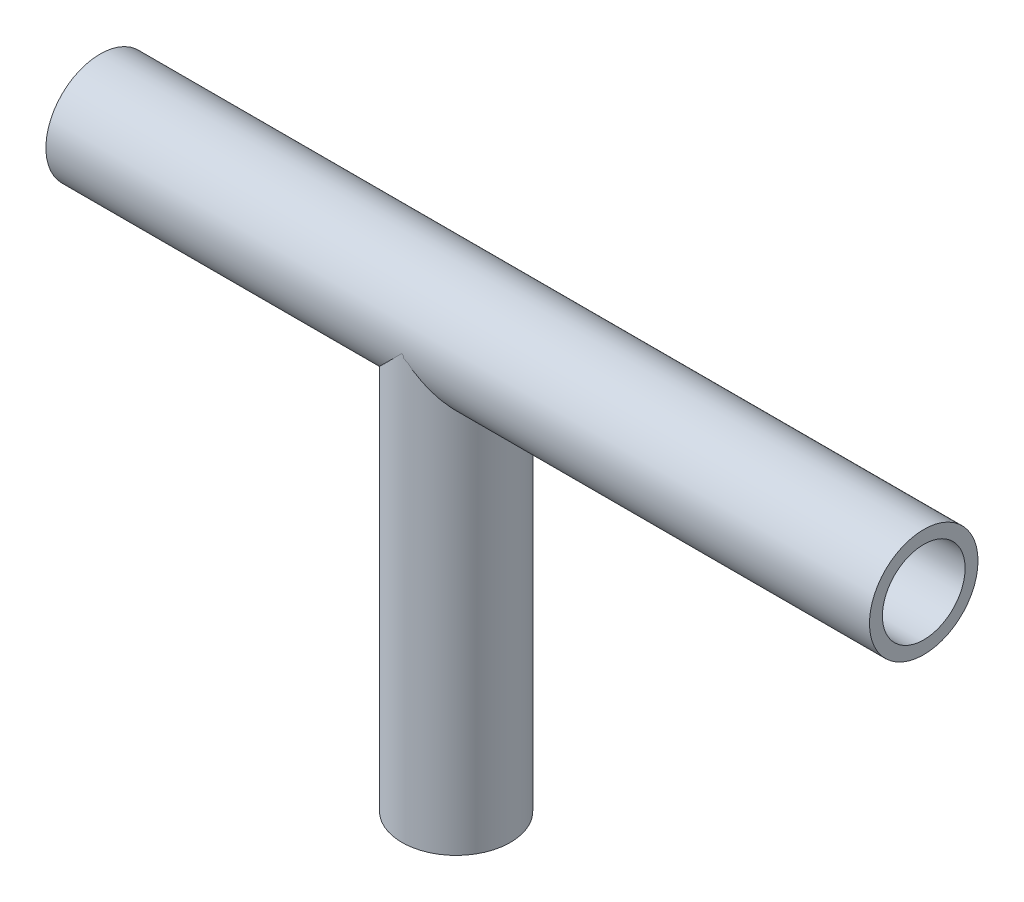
ISO-10303-21;
HEADER;
FILE_DESCRIPTION(('STEP AP214'),'2;1');
FILE_NAME('part.step','',(''),(''),'','','');
FILE_SCHEMA(('AUTOMOTIVE_DESIGN { 1 0 10303 214 1 1 1 1 }'));
ENDSEC;
DATA;
#1=APPLICATION_CONTEXT('core data for automotive mechanical design processes');
#2=APPLICATION_PROTOCOL_DEFINITION('international standard','automotive_design',2000,#1);
#3=PRODUCT_CONTEXT('',#1,'mechanical');
#4=PRODUCT('Part','Part','',(#3));
#5=PRODUCT_RELATED_PRODUCT_CATEGORY('part','',(#4));
#6=PRODUCT_DEFINITION_FORMATION('','',#4);
#7=PRODUCT_DEFINITION_CONTEXT('part definition',#1,'design');
#8=PRODUCT_DEFINITION('design','',#6,#7);
#9=PRODUCT_DEFINITION_SHAPE('','',#8);
#10=(LENGTH_UNIT() NAMED_UNIT(*) SI_UNIT(.MILLI.,.METRE.));
#11=(NAMED_UNIT(*) PLANE_ANGLE_UNIT() SI_UNIT($,.RADIAN.));
#12=(NAMED_UNIT(*) SI_UNIT($,.STERADIAN.) SOLID_ANGLE_UNIT());
#13=UNCERTAINTY_MEASURE_WITH_UNIT(LENGTH_MEASURE(1.E-05),#10,'distance_accuracy_value','');
#14=(GEOMETRIC_REPRESENTATION_CONTEXT(3) GLOBAL_UNCERTAINTY_ASSIGNED_CONTEXT((#13)) GLOBAL_UNIT_ASSIGNED_CONTEXT((#10,
#11,#12)) REPRESENTATION_CONTEXT('',''));
#15=CARTESIAN_POINT('',(0.,0.,0.));
#16=DIRECTION('',(0.,0.,1.));
#17=DIRECTION('',(1.,0.,0.));
#18=AXIS2_PLACEMENT_3D('',#15,#16,#17);
#19=CARTESIAN_POINT('',(0.,-104.982475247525,0.));
#20=DIRECTION('',(0.,1.,0.));
#21=DIRECTION('',(0.,0.,1.));
#22=AXIS2_PLACEMENT_3D('',#19,#20,#21);
#23=CYLINDRICAL_SURFACE('',#22,10.25);
#24=CARTESIAN_POINT('',(0.,-104.982475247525,0.));
#25=DIRECTION('',(0.,-1.,0.));
#26=DIRECTION('',(0.,0.,-1.));
#27=AXIS2_PLACEMENT_3D('',#24,#25,#26);
#28=CIRCLE('',#27,10.25);
#29=CARTESIAN_POINT('',(0.,-104.982475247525,-10.25));
#30=VERTEX_POINT('',#29);
#31=EDGE_CURVE('E87',#30,#30,#28,.T.);
#32=ORIENTED_EDGE('',*,*,#31,.T.);
#33=EDGE_LOOP('',(#32));
#34=FACE_BOUND('',#33,.T.);
#35=CARTESIAN_POINT('',(0.,-8.7086164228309,10.25));
#36=CARTESIAN_POINT('',(0.237482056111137,-8.70862157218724,10.2499975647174));
#37=CARTESIAN_POINT('',(0.474995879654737,-8.71838791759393,10.2417224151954));
#38=CARTESIAN_POINT('',(0.947350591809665,-8.75682508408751,10.2088748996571));
#39=CARTESIAN_POINT('',(1.18219089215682,-8.7854999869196,10.1842990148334));
#40=CARTESIAN_POINT('',(1.64757380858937,-8.86011044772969,10.1194551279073));
#41=CARTESIAN_POINT('',(1.87810192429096,-8.90609600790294,10.079141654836));
#42=CARTESIAN_POINT('',(2.33260061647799,-9.01288878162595,9.98375903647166));
#43=CARTESIAN_POINT('',(2.55656854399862,-9.07370189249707,9.92868401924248));
#44=CARTESIAN_POINT('',(3.04270192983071,-9.22137711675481,9.7918746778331));
#45=CARTESIAN_POINT('',(3.30312596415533,-9.31102635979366,9.7069782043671));
#46=CARTESIAN_POINT('',(3.81208934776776,-9.50349699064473,9.5186222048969));
#47=CARTESIAN_POINT('',(4.06062523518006,-9.60632218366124,9.4151573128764));
#48=CARTESIAN_POINT('',(4.54575571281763,-9.82123023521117,9.19076128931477));
#49=CARTESIAN_POINT('',(4.78233965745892,-9.93332112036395,9.06981494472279));
#50=CARTESIAN_POINT('',(5.24327632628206,-10.1632700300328,8.81137696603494));
#51=CARTESIAN_POINT('',(5.46763012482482,-10.2811275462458,8.67388678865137));
#52=CARTESIAN_POINT('',(5.90934044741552,-10.5226086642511,8.3793997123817));
#53=CARTESIAN_POINT('',(6.1263977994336,-10.646302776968,8.22201239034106));
#54=CARTESIAN_POINT('',(6.54742870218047,-10.8940286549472,7.89084340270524));
#55=CARTESIAN_POINT('',(6.75140179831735,-11.0180604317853,7.7170611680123));
#56=CARTESIAN_POINT('',(7.14562333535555,-11.2639347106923,7.35352914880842));
#57=CARTESIAN_POINT('',(7.33588343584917,-11.3857790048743,7.16379323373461));
#58=CARTESIAN_POINT('',(7.70220649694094,-11.6251781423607,6.76839436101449));
#59=CARTESIAN_POINT('',(7.87826485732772,-11.7427315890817,6.56272628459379));
#60=CARTESIAN_POINT('',(8.20803022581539,-11.9665252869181,6.14480068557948));
#61=CARTESIAN_POINT('',(8.36236562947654,-12.0730333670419,5.93318336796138));
#62=CARTESIAN_POINT('',(8.65585580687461,-12.2781444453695,5.49617090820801));
#63=CARTESIAN_POINT('',(8.79501766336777,-12.3767511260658,5.27078227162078));
#64=CARTESIAN_POINT('',(9.05689161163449,-12.5641924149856,4.80688289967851));
#65=CARTESIAN_POINT('',(9.1796108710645,-12.6530312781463,4.56837794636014));
#66=CARTESIAN_POINT('',(9.40722715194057,-12.8191211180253,4.07913339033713));
#67=CARTESIAN_POINT('',(9.51212710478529,-12.8963740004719,3.82839580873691));
#68=CARTESIAN_POINT('',(9.68846399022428,-13.0270248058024,3.35414883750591));
#69=CARTESIAN_POINT('',(9.76255719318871,-13.0822617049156,3.13213140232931));
#70=CARTESIAN_POINT('',(9.89586398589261,-13.1820396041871,2.68134232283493));
#71=CARTESIAN_POINT('',(9.95508013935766,-13.2265824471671,2.45257184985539));
#72=CARTESIAN_POINT('',(10.057820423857,-13.3040826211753,1.98970358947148));
#73=CARTESIAN_POINT('',(10.1013515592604,-13.3370451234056,1.75560822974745));
#74=CARTESIAN_POINT('',(10.1721145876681,-13.3907200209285,1.28356441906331));
#75=CARTESIAN_POINT('',(10.1993462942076,-13.4114322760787,1.04561592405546));
#76=CARTESIAN_POINT('',(10.2371307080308,-13.4401895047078,0.566962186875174));
#77=CARTESIAN_POINT('',(10.2476368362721,-13.4481991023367,0.326251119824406));
#78=CARTESIAN_POINT('',(10.251651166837,-13.4512583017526,-0.155396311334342));
#79=CARTESIAN_POINT('',(10.2451593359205,-13.4463078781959,-0.39633267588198));
#80=CARTESIAN_POINT('',(10.2152834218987,-13.4235584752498,-0.876570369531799));
#81=CARTESIAN_POINT('',(10.1918971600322,-13.4057578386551,-1.11587148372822));
#82=CARTESIAN_POINT('',(10.1286058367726,-13.3577031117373,-1.59100087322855));
#83=CARTESIAN_POINT('',(10.0887009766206,-13.327449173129,-1.82682919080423));
#84=CARTESIAN_POINT('',(9.9949435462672,-13.2566207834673,-2.28380542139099));
#85=CARTESIAN_POINT('',(9.94172960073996,-13.2165200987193,-2.5051588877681));
#86=CARTESIAN_POINT('',(9.82133083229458,-13.1261934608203,-2.94199103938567));
#87=CARTESIAN_POINT('',(9.75414116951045,-13.0759640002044,-3.15746766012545));
#88=CARTESIAN_POINT('',(9.60659480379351,-12.966272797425,-3.58136774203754));
#89=CARTESIAN_POINT('',(9.52624133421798,-12.9068133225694,-3.78979292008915));
#90=CARTESIAN_POINT('',(9.35313974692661,-12.7795844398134,-4.19888469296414));
#91=CARTESIAN_POINT('',(9.26038712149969,-12.7118120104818,-4.39954843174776));
#92=CARTESIAN_POINT('',(9.05290148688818,-12.561424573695,-4.81316012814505));
#93=CARTESIAN_POINT('',(8.93688163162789,-12.4779979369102,-5.02516717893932));
#94=CARTESIAN_POINT('',(8.69168642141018,-12.3035760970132,-5.43827338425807));
#95=CARTESIAN_POINT('',(8.56250556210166,-12.2125777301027,-5.63936792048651));
#96=CARTESIAN_POINT('',(8.2918972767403,-12.0243959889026,-6.03021240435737));
#97=CARTESIAN_POINT('',(8.15046498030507,-11.9272101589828,-6.21995778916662));
#98=CARTESIAN_POINT('',(7.8561810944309,-11.7280792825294,-6.58774619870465));
#99=CARTESIAN_POINT('',(7.70332807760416,-11.626133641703,-6.76578775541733));
#100=CARTESIAN_POINT('',(7.35522271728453,-11.3981876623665,-7.14436084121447));
#101=CARTESIAN_POINT('',(7.15760162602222,-11.2714515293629,-7.34227651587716));
#102=CARTESIAN_POINT('',(6.7476715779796,-11.0156887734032,-7.72070383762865));
#103=CARTESIAN_POINT('',(6.53535988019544,-10.8866617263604,-7.90121222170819));
#104=CARTESIAN_POINT('',(6.09644159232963,-10.6289699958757,-8.24461050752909));
#105=CARTESIAN_POINT('',(5.86982526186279,-10.5003056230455,-8.40748819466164));
#106=CARTESIAN_POINT('',(5.40270731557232,-10.2465011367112,-8.71501189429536));
#107=CARTESIAN_POINT('',(5.16220846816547,-10.1213603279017,-8.85966152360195));
#108=CARTESIAN_POINT('',(4.71190380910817,-9.90004265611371,-9.10570750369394));
#109=CARTESIAN_POINT('',(4.50435965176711,-9.80270518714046,-9.2102037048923));
#110=CARTESIAN_POINT('',(4.0799655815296,-9.61508664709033,-9.40590115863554));
#111=CARTESIAN_POINT('',(3.86311555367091,-9.52480566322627,-9.49710224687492));
#112=CARTESIAN_POINT('',(3.42066115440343,-9.35410857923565,-9.66527226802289));
#113=CARTESIAN_POINT('',(3.19507298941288,-9.27367526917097,-9.74226615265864));
#114=CARTESIAN_POINT('',(2.73528498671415,-9.12548627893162,-9.88121096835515));
#115=CARTESIAN_POINT('',(2.50108886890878,-9.05772519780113,-9.94316831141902));
#116=CARTESIAN_POINT('',(2.07736224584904,-8.9511519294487,-10.0390902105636));
#117=CARTESIAN_POINT('',(1.88932226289,-8.90925035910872,-10.0762142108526));
#118=CARTESIAN_POINT('',(1.50945742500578,-8.836501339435,-10.1400736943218));
#119=CARTESIAN_POINT('',(1.31763481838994,-8.80564752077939,-10.1668151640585));
#120=CARTESIAN_POINT('',(0.931408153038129,-8.7561916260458,-10.2094407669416));
#121=CARTESIAN_POINT('',(0.737006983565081,-8.73757685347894,-10.2253361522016));
#122=CARTESIAN_POINT('',(0.346794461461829,-8.71334362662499,-10.2459943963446));
#123=CARTESIAN_POINT('',(0.150983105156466,-8.70772520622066,-10.250757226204));
#124=CARTESIAN_POINT('',(-0.240826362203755,-8.70973935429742,-10.2490459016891));
#125=CARTESIAN_POINT('',(-0.436824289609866,-8.71739255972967,-10.2425542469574));
#126=CARTESIAN_POINT('',(-0.827179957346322,-8.74564574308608,-10.2184401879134));
#127=CARTESIAN_POINT('',(-1.02153769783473,-8.76624571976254,-10.2008177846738));
#128=CARTESIAN_POINT('',(-1.40748174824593,-8.81954784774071,-10.1547678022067));
#129=CARTESIAN_POINT('',(-1.599064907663,-8.85226278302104,-10.1263288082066));
#130=CARTESIAN_POINT('',(-1.97829604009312,-8.92855585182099,-10.0591235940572));
#131=CARTESIAN_POINT('',(-2.16594160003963,-8.97214044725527,-10.0203512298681));
#132=CARTESIAN_POINT('',(-2.60124260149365,-9.08560416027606,-9.91776238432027));
#133=CARTESIAN_POINT('',(-2.84694882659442,-9.1593492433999,-9.84992908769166));
#134=CARTESIAN_POINT('',(-3.32854562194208,-9.32028093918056,-9.69778863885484));
#135=CARTESIAN_POINT('',(-3.56443616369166,-9.40746759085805,-9.61348143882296));
#136=CARTESIAN_POINT('',(-4.02662773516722,-9.59211795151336,-9.42925337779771));
#137=CARTESIAN_POINT('',(-4.25290224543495,-9.68960778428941,-9.32929250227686));
#138=CARTESIAN_POINT('',(-4.69507417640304,-9.89166597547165,-9.11477749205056));
#139=CARTESIAN_POINT('',(-4.91097159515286,-9.99623433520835,-9.00022335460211));
#140=CARTESIAN_POINT('',(-5.39596113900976,-10.2420914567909,-8.72045748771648));
#141=CARTESIAN_POINT('',(-5.66146665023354,-10.3849461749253,-8.55038554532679));
#142=CARTESIAN_POINT('',(-6.17480149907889,-10.6734783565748,-8.18737883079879));
#143=CARTESIAN_POINT('',(-6.42262543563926,-10.8191566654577,-7.99443712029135));
#144=CARTESIAN_POINT('',(-6.89984402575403,-11.1090943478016,-7.58637824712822));
#145=CARTESIAN_POINT('',(-7.1292512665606,-11.2533546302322,-7.37127646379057));
#146=CARTESIAN_POINT('',(-7.56877216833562,-11.5368163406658,-6.91921363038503));
#147=CARTESIAN_POINT('',(-7.7788913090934,-11.6760191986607,-6.68225882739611));
#148=CARTESIAN_POINT('',(-8.14313383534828,-11.9220781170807,-6.23061323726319));
#149=CARTESIAN_POINT('',(-8.30059874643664,-12.030310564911,-6.01936113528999));
#150=CARTESIAN_POINT('',(-8.60032915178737,-12.2390397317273,-5.58273506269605));
#151=CARTESIAN_POINT('',(-8.74259735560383,-12.3395378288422,-5.35736362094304));
#152=CARTESIAN_POINT('',(-9.01050400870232,-12.53077797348,-4.89336279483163));
#153=CARTESIAN_POINT('',(-9.13616135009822,-12.6215310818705,-4.65474891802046));
#154=CARTESIAN_POINT('',(-9.36957991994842,-12.7915061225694,-4.16497557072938));
#155=CARTESIAN_POINT('',(-9.47734389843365,-12.8707298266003,-3.9138180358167));
#156=CARTESIAN_POINT('',(-9.6585522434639,-13.0047879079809,-3.43935952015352));
#157=CARTESIAN_POINT('',(-9.73472343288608,-13.0614990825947,-3.2176277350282));
#158=CARTESIAN_POINT('',(-9.87220526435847,-13.1642831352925,-2.76721537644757));
#159=CARTESIAN_POINT('',(-9.93351857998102,-13.2103579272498,-2.53853606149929));
#160=CARTESIAN_POINT('',(-10.0404564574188,-13.2909567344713,-2.07560754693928));
#161=CARTESIAN_POINT('',(-10.0860861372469,-13.3254845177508,-1.84136019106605));
#162=CARTESIAN_POINT('',(-10.161011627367,-13.3822852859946,-1.36878499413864));
#163=CARTESIAN_POINT('',(-10.1903072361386,-13.4045581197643,-1.1304571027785));
#164=CARTESIAN_POINT('',(-10.2321609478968,-13.4364032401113,-0.650776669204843));
#165=CARTESIAN_POINT('',(-10.2446696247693,-13.4459380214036,-0.40941729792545));
#166=CARTESIAN_POINT('',(-10.2525820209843,-13.4519675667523,0.0737463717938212));
#167=CARTESIAN_POINT('',(-10.2479857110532,-13.4484623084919,0.315550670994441));
#168=CARTESIAN_POINT('',(-10.2217639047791,-13.4284915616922,0.797710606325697));
#169=CARTESIAN_POINT('',(-10.2001369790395,-13.4120249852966,1.0380661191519));
#170=CARTESIAN_POINT('',(-10.140203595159,-13.3665010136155,1.51546972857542));
#171=CARTESIAN_POINT('',(-10.1018973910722,-13.3374438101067,1.75251787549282));
#172=CARTESIAN_POINT('',(-10.0112775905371,-13.2689427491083,2.21110495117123));
#173=CARTESIAN_POINT('',(-9.95966903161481,-13.2300229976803,2.43286272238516));
#174=CARTESIAN_POINT('',(-9.84242324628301,-13.141986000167,2.87064002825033));
#175=CARTESIAN_POINT('',(-9.77678116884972,-13.0928652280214,3.08665754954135));
#176=CARTESIAN_POINT('',(-9.63226178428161,-12.9853047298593,3.51175526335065));
#177=CARTESIAN_POINT('',(-9.55338767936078,-12.926867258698,3.72083711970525));
#178=CARTESIAN_POINT('',(-9.38317376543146,-12.8015870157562,4.13133714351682));
#179=CARTESIAN_POINT('',(-9.29182941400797,-12.7347411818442,4.33275248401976));
#180=CARTESIAN_POINT('',(-9.08760520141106,-12.5864667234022,4.74727417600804));
#181=CARTESIAN_POINT('',(-8.97347963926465,-12.5042463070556,4.95948326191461));
#182=CARTESIAN_POINT('',(-8.73208073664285,-12.3321557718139,5.37314137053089));
#183=CARTESIAN_POINT('',(-8.60480190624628,-12.2422824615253,5.57458584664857));
#184=CARTESIAN_POINT('',(-8.33801090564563,-12.0562546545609,5.96625875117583));
#185=CARTESIAN_POINT('',(-8.19849427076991,-11.9600978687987,6.15648304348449));
#186=CARTESIAN_POINT('',(-7.90805599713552,-11.7629070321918,6.52535587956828));
#187=CARTESIAN_POINT('',(-7.75713292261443,-11.6618723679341,6.70400296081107));
#188=CARTESIAN_POINT('',(-7.41347721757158,-11.4358949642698,7.08384436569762));
#189=CARTESIAN_POINT('',(-7.2183957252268,-11.3101907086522,7.28246554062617));
#190=CARTESIAN_POINT('',(-6.81362815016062,-11.0562505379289,7.66251040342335));
#191=CARTESIAN_POINT('',(-6.60393943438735,-10.9280141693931,7.84393097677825));
#192=CARTESIAN_POINT('',(-6.17036655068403,-10.6715898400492,8.18938142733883));
#193=CARTESIAN_POINT('',(-5.94647225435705,-10.5434019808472,8.35339866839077));
#194=CARTESIAN_POINT('',(-5.48492276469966,-10.2901476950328,8.66345203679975));
#195=CARTESIAN_POINT('',(-5.24727006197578,-10.165080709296,8.80949140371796));
#196=CARTESIAN_POINT('',(-4.79852235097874,-9.94155295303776,9.06043261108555));
#197=CARTESIAN_POINT('',(-4.58949331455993,-9.84210086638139,9.1681492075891));
#198=CARTESIAN_POINT('',(-4.16186943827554,-9.65011168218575,9.37001817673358));
#199=CARTESIAN_POINT('',(-3.94327439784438,-9.55757472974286,9.4641702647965));
#200=CARTESIAN_POINT('',(-3.49702198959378,-9.38227770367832,9.63797594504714));
#201=CARTESIAN_POINT('',(-3.26937989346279,-9.29950201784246,9.71765280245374));
#202=CARTESIAN_POINT('',(-2.80517804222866,-9.14664267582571,9.86166654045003));
#203=CARTESIAN_POINT('',(-2.5686222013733,-9.07655352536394,9.92601006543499));
#204=CARTESIAN_POINT('',(-2.1410035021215,-8.96611558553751,10.0257426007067));
#205=CARTESIAN_POINT('',(-1.95151158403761,-8.92261898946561,10.0643884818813));
#206=CARTESIAN_POINT('',(-1.56856377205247,-8.84676283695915,10.1311325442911));
#207=CARTESIAN_POINT('',(-1.37511025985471,-8.81439678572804,10.159236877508));
#208=CARTESIAN_POINT('',(-0.985466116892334,-8.76207387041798,10.2043993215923));
#209=CARTESIAN_POINT('',(-0.789278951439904,-8.74210253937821,10.2214703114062));
#210=CARTESIAN_POINT('',(-0.395401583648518,-8.71537345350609,10.2442701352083));
#211=CARTESIAN_POINT('',(-0.197711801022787,-8.7086121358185,10.2500020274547));
#212=CARTESIAN_POINT('',(0.,-8.7086164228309,10.25));
#213=B_SPLINE_CURVE_WITH_KNOTS('',3,(#35,#36,#37,#38,#39,#40,#41,#42,#43,#44,#45,#46,#47,#48,
#49,#50,#51,#52,#53,#54,#55,#56,#57,#58,#59,#60,#61,#62,#63,#64,#65,#66,#67,#68,#69,#70,#71,#72,
#73,#74,#75,#76,#77,#78,#79,#80,#81,#82,#83,#84,#85,#86,#87,#88,#89,#90,#91,#92,#93,#94,#95,#96,
#97,#98,#99,#100,#101,#102,#103,#104,#105,#106,#107,#108,#109,#110,#111,#112,#113,#114,#115,
#116,#117,#118,#119,#120,#121,#122,#123,#124,#125,#126,#127,#128,#129,#130,#131,#132,#133,#134,
#135,#136,#137,#138,#139,#140,#141,#142,#143,#144,#145,#146,#147,#148,#149,#150,#151,#152,#153,
#154,#155,#156,#157,#158,#159,#160,#161,#162,#163,#164,#165,#166,#167,#168,#169,#170,#171,#172,
#173,#174,#175,#176,#177,#178,#179,#180,#181,#182,#183,#184,#185,#186,#187,#188,#189,#190,#191,
#192,#193,#194,#195,#196,#197,#198,#199,#200,#201,#202,#203,#204,#205,#206,#207,#208,#209,#210,
#211,#212),.UNSPECIFIED.,.T.,.F.,(4,2,2,2,2,2,2,2,2,2,2,2,2,2,2,2,2,2,2,2,2,2,2,2,2,2,2,2,2,2,2,
2,2,2,2,2,2,2,2,2,2,2,2,2,2,2,2,2,2,2,2,2,2,2,2,2,2,2,2,2,2,2,2,2,2,2,2,2,2,2,2,2,2,2,2,2,2,2,2,
2,2,2,2,2,2,2,2,2,4),(0.,0.71216674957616,1.42448728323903,2.13888135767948,2.85356003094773,
3.71684976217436,4.5803893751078,5.44468505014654,6.30890467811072,7.19396319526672,
8.07905244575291,8.96338003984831,9.84799294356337,10.6954280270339,11.5424658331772,
12.3891331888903,13.2356611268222,13.9563719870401,14.6769585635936,15.3972229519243,
16.1174955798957,16.8397706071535,17.5620470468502,18.2844166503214,19.0067774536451,
19.6995345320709,20.3925319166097,21.0853593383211,21.7784393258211,22.5447188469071,
23.3113201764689,24.0782276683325,24.8452311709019,25.7655123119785,26.6859656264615,
27.6070526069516,28.5279565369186,29.2831927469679,30.0384382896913,30.7923445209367,
31.5459286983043,32.1339587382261,32.7216492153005,33.3087290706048,33.8958104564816,
34.4838055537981,35.0718005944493,35.6604178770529,36.2493859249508,37.0442125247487,
37.8390414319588,38.6359363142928,39.4328313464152,40.4699825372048,41.5074491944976,
42.5442006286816,43.5806566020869,44.434404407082,45.2879997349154,46.1406157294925,
46.9931005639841,47.7159963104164,48.4387618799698,49.161291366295,49.8838297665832,
50.6084909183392,51.3331533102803,52.0578765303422,52.7825887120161,53.4748078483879,
54.1672666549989,54.8595581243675,55.5521024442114,56.3151500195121,57.0785173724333,
57.8421643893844,58.6059076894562,59.5214067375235,60.4370712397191,61.3533960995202,
62.2695555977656,63.0349399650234,63.8003403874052,64.5644995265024,65.3283269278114,
65.9224312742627,66.5161883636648,67.1092511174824,67.7021538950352),.UNSPECIFIED.);
#214=CARTESIAN_POINT('',(0.,-8.7086164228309,10.25));
#215=VERTEX_POINT('',#214);
#216=EDGE_CURVE('E52',#215,#215,#213,.T.);
#217=ORIENTED_EDGE('',*,*,#216,.T.);
#218=EDGE_LOOP('',(#217));
#219=FACE_BOUND('',#218,.T.);
#220=ADVANCED_FACE('F47',(#34,#219),#23,.F.);
#221=CARTESIAN_POINT('',(0.,-104.982475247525,0.));
#222=DIRECTION('',(0.,1.,0.));
#223=DIRECTION('',(0.,0.,1.));
#224=AXIS2_PLACEMENT_3D('',#221,#222,#223);
#225=CYLINDRICAL_SURFACE('',#224,13.45);
#226=CARTESIAN_POINT('',(0.,-104.982475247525,0.));
#227=DIRECTION('',(0.,-1.,0.));
#228=DIRECTION('',(0.,0.,-1.));
#229=AXIS2_PLACEMENT_3D('',#226,#227,#228);
#230=CIRCLE('',#229,13.45);
#231=CARTESIAN_POINT('',(0.,-104.982475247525,-13.45));
#232=VERTEX_POINT('',#231);
#233=EDGE_CURVE('E68',#232,#232,#230,.T.);
#234=ORIENTED_EDGE('',*,*,#233,.F.);
#235=EDGE_LOOP('',(#234));
#236=FACE_BOUND('',#235,.T.);
#237=CARTESIAN_POINT('',(0.,0.,0.));
#238=DIRECTION('',(-0.707106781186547,0.707106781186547,0.));
#239=DIRECTION('',(0.707106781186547,0.707106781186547,0.));
#240=AXIS2_PLACEMENT_3D('',#237,#238,#239);
#241=ELLIPSE('',#240,19.0211724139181,13.45);
#242=CARTESIAN_POINT('',(0.,0.,-13.45));
#243=VERTEX_POINT('',#242);
#244=CARTESIAN_POINT('',(0.,0.,13.45));
#245=VERTEX_POINT('',#244);
#246=EDGE_CURVE('E61',#243,#245,#241,.T.);
#247=ORIENTED_EDGE('',*,*,#246,.F.);
#248=CARTESIAN_POINT('',(0.,0.,0.));
#249=DIRECTION('',(0.707106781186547,0.707106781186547,0.));
#250=DIRECTION('',(-0.707106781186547,0.707106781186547,0.));
#251=AXIS2_PLACEMENT_3D('',#248,#249,#250);
#252=ELLIPSE('',#251,19.0211724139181,13.45);
#253=EDGE_CURVE('E12',#245,#243,#252,.T.);
#254=ORIENTED_EDGE('',*,*,#253,.F.);
#255=EDGE_LOOP('',(#247,#254));
#256=FACE_BOUND('',#255,.T.);
#257=ADVANCED_FACE('F70',(#236,#256),#225,.T.);
#258=CARTESIAN_POINT('',(0.,-104.982475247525,0.));
#259=DIRECTION('',(0.,-1.,0.));
#260=DIRECTION('',(0.,0.,-1.));
#261=AXIS2_PLACEMENT_3D('',#258,#259,#260);
#262=PLANE('',#261);
#263=ORIENTED_EDGE('',*,*,#31,.F.);
#264=EDGE_LOOP('',(#263));
#265=FACE_BOUND('',#264,.T.);
#266=ORIENTED_EDGE('',*,*,#233,.T.);
#267=EDGE_LOOP('',(#266));
#268=FACE_BOUND('',#267,.T.);
#269=ADVANCED_FACE('F72',(#265,#268),#262,.T.);
#270=CARTESIAN_POINT('',(115.909504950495,0.,0.));
#271=DIRECTION('',(-1.,0.,0.));
#272=DIRECTION('',(0.,0.,1.));
#273=AXIS2_PLACEMENT_3D('',#270,#271,#272);
#274=CYLINDRICAL_SURFACE('',#273,13.45);
#275=ORIENTED_EDGE('',*,*,#216,.F.);
#276=EDGE_LOOP('',(#275));
#277=FACE_BOUND('',#276,.T.);
#278=ORIENTED_EDGE('',*,*,#246,.T.);
#279=ORIENTED_EDGE('',*,*,#253,.T.);
#280=EDGE_LOOP('',(#278,#279));
#281=FACE_BOUND('',#280,.T.);
#282=ADVANCED_FACE('F49',(#277,#281),#274,.F.);
#283=CLOSED_SHELL('',(#220,#257,#269,#282));
#284=MANIFOLD_SOLID_BREP('B2',#283);
#285=CARTESIAN_POINT('',(115.909504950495,0.,0.));
#286=DIRECTION('',(-1.,0.,0.));
#287=DIRECTION('',(0.,0.,1.));
#288=AXIS2_PLACEMENT_3D('',#285,#286,#287);
#289=CYLINDRICAL_SURFACE('',#288,10.25);
#290=CARTESIAN_POINT('',(0.,0.,0.));
#291=DIRECTION('',(-0.707106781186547,-0.707106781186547,0.));
#292=DIRECTION('',(-0.707106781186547,0.707106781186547,0.));
#293=AXIS2_PLACEMENT_3D('',#290,#291,#292);
#294=ELLIPSE('',#293,14.4956890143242,10.25);
#295=CARTESIAN_POINT('',(0.,0.,10.25));
#296=VERTEX_POINT('',#295);
#297=CARTESIAN_POINT('',(0.,0.,-10.25));
#298=VERTEX_POINT('',#297);
#299=EDGE_CURVE('E145',#296,#298,#294,.F.);
#300=ORIENTED_EDGE('',*,*,#299,.F.);
#301=CARTESIAN_POINT('',(0.,0.,0.));
#302=DIRECTION('',(-0.707106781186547,0.707106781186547,0.));
#303=DIRECTION('',(-0.707106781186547,-0.707106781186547,0.));
#304=AXIS2_PLACEMENT_3D('',#301,#302,#303);
#305=ELLIPSE('',#304,14.4956890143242,10.25);
#306=EDGE_CURVE('E147',#298,#296,#305,.T.);
#307=ORIENTED_EDGE('',*,*,#306,.F.);
#308=EDGE_LOOP('',(#300,#307));
#309=FACE_BOUND('',#308,.T.);
#310=CARTESIAN_POINT('',(115.909504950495,0.,0.));
#311=DIRECTION('',(1.,0.,0.));
#312=DIRECTION('',(0.,0.,-1.));
#313=AXIS2_PLACEMENT_3D('',#310,#311,#312);
#314=CIRCLE('',#313,10.25);
#315=CARTESIAN_POINT('',(115.909504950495,0.,-10.25));
#316=VERTEX_POINT('',#315);
#317=EDGE_CURVE('E138',#316,#316,#314,.T.);
#318=ORIENTED_EDGE('',*,*,#317,.T.);
#319=EDGE_LOOP('',(#318));
#320=FACE_BOUND('',#319,.T.);
#321=CARTESIAN_POINT('',(-88.2461386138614,0.,0.));
#322=DIRECTION('',(1.,0.,0.));
#323=DIRECTION('',(0.,0.,-1.));
#324=AXIS2_PLACEMENT_3D('',#321,#322,#323);
#325=CIRCLE('',#324,10.25);
#326=CARTESIAN_POINT('',(-88.2461386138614,0.,-10.25));
#327=VERTEX_POINT('',#326);
#328=EDGE_CURVE('E153',#327,#327,#325,.T.);
#329=ORIENTED_EDGE('',*,*,#328,.F.);
#330=EDGE_LOOP('',(#329));
#331=FACE_BOUND('',#330,.T.);
#332=ADVANCED_FACE('F127',(#309,#320,#331),#289,.F.);
#333=CARTESIAN_POINT('',(115.909504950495,0.,0.));
#334=DIRECTION('',(-1.,0.,0.));
#335=DIRECTION('',(0.,0.,1.));
#336=AXIS2_PLACEMENT_3D('',#333,#334,#335);
#337=CYLINDRICAL_SURFACE('',#336,13.45);
#338=CARTESIAN_POINT('',(0.,-8.7086164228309,-10.25));
#339=CARTESIAN_POINT('',(-0.237482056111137,-8.70862157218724,-10.2499975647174));
#340=CARTESIAN_POINT('',(-0.474995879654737,-8.71838791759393,-10.2417224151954));
#341=CARTESIAN_POINT('',(-0.947350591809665,-8.75682508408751,-10.2088748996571));
#342=CARTESIAN_POINT('',(-1.18219089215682,-8.7854999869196,-10.1842990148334));
#343=CARTESIAN_POINT('',(-1.64757380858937,-8.86011044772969,-10.1194551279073));
#344=CARTESIAN_POINT('',(-1.87810192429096,-8.90609600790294,-10.079141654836));
#345=CARTESIAN_POINT('',(-2.33260061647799,-9.01288878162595,-9.98375903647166));
#346=CARTESIAN_POINT('',(-2.55656854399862,-9.07370189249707,-9.92868401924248));
#347=CARTESIAN_POINT('',(-3.04270192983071,-9.22137711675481,-9.7918746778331));
#348=CARTESIAN_POINT('',(-3.30312596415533,-9.31102635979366,-9.7069782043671));
#349=CARTESIAN_POINT('',(-3.81208934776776,-9.50349699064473,-9.5186222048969));
#350=CARTESIAN_POINT('',(-4.06062523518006,-9.60632218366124,-9.4151573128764));
#351=CARTESIAN_POINT('',(-4.54575571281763,-9.82123023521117,-9.19076128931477));
#352=CARTESIAN_POINT('',(-4.78233965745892,-9.93332112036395,-9.06981494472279));
#353=CARTESIAN_POINT('',(-5.24327632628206,-10.1632700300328,-8.81137696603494));
#354=CARTESIAN_POINT('',(-5.46763012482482,-10.2811275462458,-8.67388678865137));
#355=CARTESIAN_POINT('',(-5.90934044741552,-10.5226086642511,-8.3793997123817));
#356=CARTESIAN_POINT('',(-6.1263977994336,-10.646302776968,-8.22201239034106));
#357=CARTESIAN_POINT('',(-6.54742870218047,-10.8940286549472,-7.89084340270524));
#358=CARTESIAN_POINT('',(-6.75140179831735,-11.0180604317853,-7.7170611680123));
#359=CARTESIAN_POINT('',(-7.14562333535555,-11.2639347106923,-7.35352914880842));
#360=CARTESIAN_POINT('',(-7.33588343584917,-11.3857790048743,-7.16379323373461));
#361=CARTESIAN_POINT('',(-7.70220649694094,-11.6251781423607,-6.76839436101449));
#362=CARTESIAN_POINT('',(-7.87826485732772,-11.7427315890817,-6.56272628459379));
#363=CARTESIAN_POINT('',(-8.20803022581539,-11.9665252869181,-6.14480068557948));
#364=CARTESIAN_POINT('',(-8.36236562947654,-12.0730333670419,-5.93318336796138));
#365=CARTESIAN_POINT('',(-8.65585580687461,-12.2781444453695,-5.49617090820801));
#366=CARTESIAN_POINT('',(-8.79501766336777,-12.3767511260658,-5.27078227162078));
#367=CARTESIAN_POINT('',(-9.05689161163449,-12.5641924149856,-4.80688289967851));
#368=CARTESIAN_POINT('',(-9.1796108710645,-12.6530312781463,-4.56837794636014));
#369=CARTESIAN_POINT('',(-9.40722715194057,-12.8191211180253,-4.07913339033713));
#370=CARTESIAN_POINT('',(-9.51212710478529,-12.8963740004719,-3.82839580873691));
#371=CARTESIAN_POINT('',(-9.68846399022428,-13.0270248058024,-3.35414883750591));
#372=CARTESIAN_POINT('',(-9.76255719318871,-13.0822617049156,-3.13213140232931));
#373=CARTESIAN_POINT('',(-9.89586398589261,-13.1820396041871,-2.68134232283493));
#374=CARTESIAN_POINT('',(-9.95508013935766,-13.2265824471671,-2.45257184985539));
#375=CARTESIAN_POINT('',(-10.057820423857,-13.3040826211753,-1.98970358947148));
#376=CARTESIAN_POINT('',(-10.1013515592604,-13.3370451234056,-1.75560822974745));
#377=CARTESIAN_POINT('',(-10.1721145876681,-13.3907200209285,-1.28356441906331));
#378=CARTESIAN_POINT('',(-10.1993462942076,-13.4114322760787,-1.04561592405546));
#379=CARTESIAN_POINT('',(-10.2371307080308,-13.4401895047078,-0.566962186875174));
#380=CARTESIAN_POINT('',(-10.2476368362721,-13.4481991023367,-0.326251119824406));
#381=CARTESIAN_POINT('',(-10.251651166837,-13.4512583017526,0.155396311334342));
#382=CARTESIAN_POINT('',(-10.2451593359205,-13.4463078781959,0.39633267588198));
#383=CARTESIAN_POINT('',(-10.2152834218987,-13.4235584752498,0.876570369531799));
#384=CARTESIAN_POINT('',(-10.1918971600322,-13.4057578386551,1.11587148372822));
#385=CARTESIAN_POINT('',(-10.1286058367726,-13.3577031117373,1.59100087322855));
#386=CARTESIAN_POINT('',(-10.0887009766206,-13.327449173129,1.82682919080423));
#387=CARTESIAN_POINT('',(-9.9949435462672,-13.2566207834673,2.28380542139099));
#388=CARTESIAN_POINT('',(-9.94172960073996,-13.2165200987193,2.5051588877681));
#389=CARTESIAN_POINT('',(-9.82133083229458,-13.1261934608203,2.94199103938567));
#390=CARTESIAN_POINT('',(-9.75414116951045,-13.0759640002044,3.15746766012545));
#391=CARTESIAN_POINT('',(-9.60659480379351,-12.966272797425,3.58136774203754));
#392=CARTESIAN_POINT('',(-9.52624133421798,-12.9068133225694,3.78979292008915));
#393=CARTESIAN_POINT('',(-9.35313974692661,-12.7795844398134,4.19888469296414));
#394=CARTESIAN_POINT('',(-9.26038712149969,-12.7118120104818,4.39954843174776));
#395=CARTESIAN_POINT('',(-9.05290148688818,-12.561424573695,4.81316012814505));
#396=CARTESIAN_POINT('',(-8.93688163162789,-12.4779979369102,5.02516717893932));
#397=CARTESIAN_POINT('',(-8.69168642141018,-12.3035760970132,5.43827338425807));
#398=CARTESIAN_POINT('',(-8.56250556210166,-12.2125777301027,5.63936792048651));
#399=CARTESIAN_POINT('',(-8.2918972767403,-12.0243959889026,6.03021240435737));
#400=CARTESIAN_POINT('',(-8.15046498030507,-11.9272101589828,6.21995778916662));
#401=CARTESIAN_POINT('',(-7.8561810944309,-11.7280792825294,6.58774619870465));
#402=CARTESIAN_POINT('',(-7.70332807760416,-11.626133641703,6.76578775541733));
#403=CARTESIAN_POINT('',(-7.35522271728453,-11.3981876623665,7.14436084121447));
#404=CARTESIAN_POINT('',(-7.15760162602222,-11.2714515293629,7.34227651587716));
#405=CARTESIAN_POINT('',(-6.7476715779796,-11.0156887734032,7.72070383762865));
#406=CARTESIAN_POINT('',(-6.53535988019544,-10.8866617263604,7.90121222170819));
#407=CARTESIAN_POINT('',(-6.09644159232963,-10.6289699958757,8.24461050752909));
#408=CARTESIAN_POINT('',(-5.86982526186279,-10.5003056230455,8.40748819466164));
#409=CARTESIAN_POINT('',(-5.40270731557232,-10.2465011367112,8.71501189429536));
#410=CARTESIAN_POINT('',(-5.16220846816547,-10.1213603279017,8.85966152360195));
#411=CARTESIAN_POINT('',(-4.71190380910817,-9.90004265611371,9.10570750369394));
#412=CARTESIAN_POINT('',(-4.50435965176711,-9.80270518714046,9.2102037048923));
#413=CARTESIAN_POINT('',(-4.0799655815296,-9.61508664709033,9.40590115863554));
#414=CARTESIAN_POINT('',(-3.86311555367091,-9.52480566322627,9.49710224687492));
#415=CARTESIAN_POINT('',(-3.42066115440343,-9.35410857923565,9.66527226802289));
#416=CARTESIAN_POINT('',(-3.19507298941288,-9.27367526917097,9.74226615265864));
#417=CARTESIAN_POINT('',(-2.73528498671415,-9.12548627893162,9.88121096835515));
#418=CARTESIAN_POINT('',(-2.50108886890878,-9.05772519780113,9.94316831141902));
#419=CARTESIAN_POINT('',(-2.07736224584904,-8.9511519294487,10.0390902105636));
#420=CARTESIAN_POINT('',(-1.88932226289,-8.90925035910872,10.0762142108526));
#421=CARTESIAN_POINT('',(-1.50945742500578,-8.836501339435,10.1400736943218));
#422=CARTESIAN_POINT('',(-1.31763481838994,-8.80564752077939,10.1668151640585));
#423=CARTESIAN_POINT('',(-0.931408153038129,-8.7561916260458,10.2094407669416));
#424=CARTESIAN_POINT('',(-0.737006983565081,-8.73757685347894,10.2253361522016));
#425=CARTESIAN_POINT('',(-0.346794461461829,-8.71334362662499,10.2459943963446));
#426=CARTESIAN_POINT('',(-0.150983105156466,-8.70772520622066,10.250757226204));
#427=CARTESIAN_POINT('',(0.240826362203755,-8.70973935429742,10.2490459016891));
#428=CARTESIAN_POINT('',(0.436824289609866,-8.71739255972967,10.2425542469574));
#429=CARTESIAN_POINT('',(0.827179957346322,-8.74564574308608,10.2184401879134));
#430=CARTESIAN_POINT('',(1.02153769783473,-8.76624571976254,10.2008177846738));
#431=CARTESIAN_POINT('',(1.40748174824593,-8.81954784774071,10.1547678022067));
#432=CARTESIAN_POINT('',(1.599064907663,-8.85226278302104,10.1263288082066));
#433=CARTESIAN_POINT('',(1.97829604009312,-8.92855585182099,10.0591235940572));
#434=CARTESIAN_POINT('',(2.16594160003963,-8.97214044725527,10.0203512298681));
#435=CARTESIAN_POINT('',(2.60124260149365,-9.08560416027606,9.91776238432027));
#436=CARTESIAN_POINT('',(2.84694882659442,-9.1593492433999,9.84992908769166));
#437=CARTESIAN_POINT('',(3.32854562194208,-9.32028093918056,9.69778863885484));
#438=CARTESIAN_POINT('',(3.56443616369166,-9.40746759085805,9.61348143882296));
#439=CARTESIAN_POINT('',(4.02662773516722,-9.59211795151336,9.42925337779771));
#440=CARTESIAN_POINT('',(4.25290224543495,-9.68960778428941,9.32929250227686));
#441=CARTESIAN_POINT('',(4.69507417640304,-9.89166597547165,9.11477749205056));
#442=CARTESIAN_POINT('',(4.91097159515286,-9.99623433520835,9.00022335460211));
#443=CARTESIAN_POINT('',(5.39596113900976,-10.2420914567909,8.72045748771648));
#444=CARTESIAN_POINT('',(5.66146665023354,-10.3849461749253,8.55038554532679));
#445=CARTESIAN_POINT('',(6.17480149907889,-10.6734783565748,8.18737883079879));
#446=CARTESIAN_POINT('',(6.42262543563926,-10.8191566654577,7.99443712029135));
#447=CARTESIAN_POINT('',(6.89984402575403,-11.1090943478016,7.58637824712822));
#448=CARTESIAN_POINT('',(7.1292512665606,-11.2533546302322,7.37127646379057));
#449=CARTESIAN_POINT('',(7.56877216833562,-11.5368163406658,6.91921363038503));
#450=CARTESIAN_POINT('',(7.7788913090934,-11.6760191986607,6.68225882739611));
#451=CARTESIAN_POINT('',(8.14313383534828,-11.9220781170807,6.23061323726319));
#452=CARTESIAN_POINT('',(8.30059874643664,-12.030310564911,6.01936113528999));
#453=CARTESIAN_POINT('',(8.60032915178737,-12.2390397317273,5.58273506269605));
#454=CARTESIAN_POINT('',(8.74259735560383,-12.3395378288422,5.35736362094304));
#455=CARTESIAN_POINT('',(9.01050400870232,-12.53077797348,4.89336279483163));
#456=CARTESIAN_POINT('',(9.13616135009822,-12.6215310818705,4.65474891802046));
#457=CARTESIAN_POINT('',(9.36957991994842,-12.7915061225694,4.16497557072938));
#458=CARTESIAN_POINT('',(9.47734389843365,-12.8707298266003,3.9138180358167));
#459=CARTESIAN_POINT('',(9.6585522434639,-13.0047879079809,3.43935952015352));
#460=CARTESIAN_POINT('',(9.73472343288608,-13.0614990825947,3.2176277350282));
#461=CARTESIAN_POINT('',(9.87220526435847,-13.1642831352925,2.76721537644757));
#462=CARTESIAN_POINT('',(9.93351857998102,-13.2103579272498,2.53853606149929));
#463=CARTESIAN_POINT('',(10.0404564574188,-13.2909567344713,2.07560754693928));
#464=CARTESIAN_POINT('',(10.0860861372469,-13.3254845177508,1.84136019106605));
#465=CARTESIAN_POINT('',(10.161011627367,-13.3822852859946,1.36878499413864));
#466=CARTESIAN_POINT('',(10.1903072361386,-13.4045581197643,1.1304571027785));
#467=CARTESIAN_POINT('',(10.2321609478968,-13.4364032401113,0.650776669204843));
#468=CARTESIAN_POINT('',(10.2446696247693,-13.4459380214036,0.40941729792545));
#469=CARTESIAN_POINT('',(10.2525820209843,-13.4519675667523,-0.0737463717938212));
#470=CARTESIAN_POINT('',(10.2479857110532,-13.4484623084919,-0.315550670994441));
#471=CARTESIAN_POINT('',(10.2217639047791,-13.4284915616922,-0.797710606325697));
#472=CARTESIAN_POINT('',(10.2001369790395,-13.4120249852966,-1.0380661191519));
#473=CARTESIAN_POINT('',(10.140203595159,-13.3665010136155,-1.51546972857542));
#474=CARTESIAN_POINT('',(10.1018973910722,-13.3374438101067,-1.75251787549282));
#475=CARTESIAN_POINT('',(10.0112775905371,-13.2689427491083,-2.21110495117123));
#476=CARTESIAN_POINT('',(9.95966903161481,-13.2300229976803,-2.43286272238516));
#477=CARTESIAN_POINT('',(9.84242324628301,-13.141986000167,-2.87064002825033));
#478=CARTESIAN_POINT('',(9.77678116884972,-13.0928652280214,-3.08665754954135));
#479=CARTESIAN_POINT('',(9.63226178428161,-12.9853047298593,-3.51175526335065));
#480=CARTESIAN_POINT('',(9.55338767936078,-12.926867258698,-3.72083711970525));
#481=CARTESIAN_POINT('',(9.38317376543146,-12.8015870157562,-4.13133714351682));
#482=CARTESIAN_POINT('',(9.29182941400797,-12.7347411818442,-4.33275248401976));
#483=CARTESIAN_POINT('',(9.08760520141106,-12.5864667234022,-4.74727417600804));
#484=CARTESIAN_POINT('',(8.97347963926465,-12.5042463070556,-4.95948326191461));
#485=CARTESIAN_POINT('',(8.73208073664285,-12.3321557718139,-5.37314137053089));
#486=CARTESIAN_POINT('',(8.60480190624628,-12.2422824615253,-5.57458584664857));
#487=CARTESIAN_POINT('',(8.33801090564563,-12.0562546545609,-5.96625875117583));
#488=CARTESIAN_POINT('',(8.19849427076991,-11.9600978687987,-6.15648304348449));
#489=CARTESIAN_POINT('',(7.90805599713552,-11.7629070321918,-6.52535587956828));
#490=CARTESIAN_POINT('',(7.75713292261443,-11.6618723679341,-6.70400296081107));
#491=CARTESIAN_POINT('',(7.41347721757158,-11.4358949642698,-7.08384436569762));
#492=CARTESIAN_POINT('',(7.2183957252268,-11.3101907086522,-7.28246554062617));
#493=CARTESIAN_POINT('',(6.81362815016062,-11.0562505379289,-7.66251040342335));
#494=CARTESIAN_POINT('',(6.60393943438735,-10.9280141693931,-7.84393097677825));
#495=CARTESIAN_POINT('',(6.17036655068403,-10.6715898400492,-8.18938142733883));
#496=CARTESIAN_POINT('',(5.94647225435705,-10.5434019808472,-8.35339866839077));
#497=CARTESIAN_POINT('',(5.48492276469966,-10.2901476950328,-8.66345203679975));
#498=CARTESIAN_POINT('',(5.24727006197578,-10.165080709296,-8.80949140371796));
#499=CARTESIAN_POINT('',(4.79852235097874,-9.94155295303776,-9.06043261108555));
#500=CARTESIAN_POINT('',(4.58949331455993,-9.84210086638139,-9.1681492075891));
#501=CARTESIAN_POINT('',(4.16186943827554,-9.65011168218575,-9.37001817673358));
#502=CARTESIAN_POINT('',(3.94327439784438,-9.55757472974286,-9.4641702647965));
#503=CARTESIAN_POINT('',(3.49702198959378,-9.38227770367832,-9.63797594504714));
#504=CARTESIAN_POINT('',(3.26937989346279,-9.29950201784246,-9.71765280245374));
#505=CARTESIAN_POINT('',(2.80517804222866,-9.14664267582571,-9.86166654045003));
#506=CARTESIAN_POINT('',(2.5686222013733,-9.07655352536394,-9.92601006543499));
#507=CARTESIAN_POINT('',(2.1410035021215,-8.96611558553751,-10.0257426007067));
#508=CARTESIAN_POINT('',(1.95151158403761,-8.92261898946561,-10.0643884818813));
#509=CARTESIAN_POINT('',(1.56856377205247,-8.84676283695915,-10.1311325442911));
#510=CARTESIAN_POINT('',(1.37511025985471,-8.81439678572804,-10.159236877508));
#511=CARTESIAN_POINT('',(0.985466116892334,-8.76207387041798,-10.2043993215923));
#512=CARTESIAN_POINT('',(0.789278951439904,-8.74210253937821,-10.2214703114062));
#513=CARTESIAN_POINT('',(0.395401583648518,-8.71537345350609,-10.2442701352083));
#514=CARTESIAN_POINT('',(0.197711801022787,-8.7086121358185,-10.2500020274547));
#515=CARTESIAN_POINT('',(0.,-8.7086164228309,-10.25));
#516=B_SPLINE_CURVE_WITH_KNOTS('',3,(#338,#339,#340,#341,#342,#343,#344,#345,#346,#347,#348,
#349,#350,#351,#352,#353,#354,#355,#356,#357,#358,#359,#360,#361,#362,#363,#364,#365,#366,#367,
#368,#369,#370,#371,#372,#373,#374,#375,#376,#377,#378,#379,#380,#381,#382,#383,#384,#385,#386,
#387,#388,#389,#390,#391,#392,#393,#394,#395,#396,#397,#398,#399,#400,#401,#402,#403,#404,#405,
#406,#407,#408,#409,#410,#411,#412,#413,#414,#415,#416,#417,#418,#419,#420,#421,#422,#423,#424,
#425,#426,#427,#428,#429,#430,#431,#432,#433,#434,#435,#436,#437,#438,#439,#440,#441,#442,#443,
#444,#445,#446,#447,#448,#449,#450,#451,#452,#453,#454,#455,#456,#457,#458,#459,#460,#461,#462,
#463,#464,#465,#466,#467,#468,#469,#470,#471,#472,#473,#474,#475,#476,#477,#478,#479,#480,#481,
#482,#483,#484,#485,#486,#487,#488,#489,#490,#491,#492,#493,#494,#495,#496,#497,#498,#499,#500,
#501,#502,#503,#504,#505,#506,#507,#508,#509,#510,#511,#512,#513,#514,#515),.UNSPECIFIED.,.T.,
.F.,(4,2,2,2,2,2,2,2,2,2,2,2,2,2,2,2,2,2,2,2,2,2,2,2,2,2,2,2,2,2,2,2,2,2,2,2,2,2,2,2,2,2,2,2,2,
2,2,2,2,2,2,2,2,2,2,2,2,2,2,2,2,2,2,2,2,2,2,2,2,2,2,2,2,2,2,2,2,2,2,2,2,2,2,2,2,2,2,2,4),(0.,
0.71216674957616,1.42448728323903,2.13888135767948,2.85356003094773,3.71684976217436,
4.5803893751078,5.44468505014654,6.30890467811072,7.19396319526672,8.07905244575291,
8.96338003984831,9.84799294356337,10.6954280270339,11.5424658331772,12.3891331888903,
13.2356611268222,13.9563719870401,14.6769585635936,15.3972229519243,16.1174955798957,
16.8397706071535,17.5620470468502,18.2844166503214,19.0067774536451,19.6995345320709,
20.3925319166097,21.0853593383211,21.7784393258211,22.5447188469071,23.3113201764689,
24.0782276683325,24.8452311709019,25.7655123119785,26.6859656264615,27.6070526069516,
28.5279565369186,29.2831927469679,30.0384382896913,30.7923445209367,31.5459286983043,
32.1339587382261,32.7216492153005,33.3087290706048,33.8958104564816,34.4838055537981,
35.0718005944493,35.6604178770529,36.2493859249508,37.0442125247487,37.8390414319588,
38.6359363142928,39.4328313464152,40.4699825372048,41.5074491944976,42.5442006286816,
43.5806566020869,44.434404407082,45.2879997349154,46.1406157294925,46.9931005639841,
47.7159963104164,48.4387618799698,49.161291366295,49.8838297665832,50.6084909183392,
51.3331533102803,52.0578765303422,52.7825887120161,53.4748078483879,54.1672666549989,
54.8595581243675,55.5521024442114,56.3151500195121,57.0785173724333,57.8421643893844,
58.6059076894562,59.5214067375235,60.4370712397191,61.3533960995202,62.2695555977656,
63.0349399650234,63.8003403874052,64.5644995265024,65.3283269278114,65.9224312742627,
66.5161883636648,67.1092511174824,67.7021538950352),.UNSPECIFIED.);
#517=CARTESIAN_POINT('',(0.,-8.7086164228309,-10.25));
#518=VERTEX_POINT('',#517);
#519=EDGE_CURVE('E130',#518,#518,#516,.T.);
#520=ORIENTED_EDGE('',*,*,#519,.T.);
#521=EDGE_LOOP('',(#520));
#522=FACE_BOUND('',#521,.T.);
#523=CARTESIAN_POINT('',(115.909504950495,0.,0.));
#524=DIRECTION('',(1.,0.,0.));
#525=DIRECTION('',(0.,0.,-1.));
#526=AXIS2_PLACEMENT_3D('',#523,#524,#525);
#527=CIRCLE('',#526,13.45);
#528=CARTESIAN_POINT('',(115.909504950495,0.,-13.45));
#529=VERTEX_POINT('',#528);
#530=EDGE_CURVE('E45',#529,#529,#527,.T.);
#531=ORIENTED_EDGE('',*,*,#530,.F.);
#532=EDGE_LOOP('',(#531));
#533=FACE_BOUND('',#532,.T.);
#534=CARTESIAN_POINT('',(-88.2461386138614,0.,0.));
#535=DIRECTION('',(1.,0.,0.));
#536=DIRECTION('',(0.,0.,-1.));
#537=AXIS2_PLACEMENT_3D('',#534,#535,#536);
#538=CIRCLE('',#537,13.45);
#539=CARTESIAN_POINT('',(-88.2461386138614,0.,-13.45));
#540=VERTEX_POINT('',#539);
#541=EDGE_CURVE('E156',#540,#540,#538,.T.);
#542=ORIENTED_EDGE('',*,*,#541,.T.);
#543=EDGE_LOOP('',(#542));
#544=FACE_BOUND('',#543,.T.);
#545=ADVANCED_FACE('F163',(#522,#533,#544),#337,.T.);
#546=CARTESIAN_POINT('',(115.909504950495,0.,0.));
#547=DIRECTION('',(1.,0.,0.));
#548=DIRECTION('',(0.,0.,-1.));
#549=AXIS2_PLACEMENT_3D('',#546,#547,#548);
#550=PLANE('',#549);
#551=ORIENTED_EDGE('',*,*,#317,.F.);
#552=EDGE_LOOP('',(#551));
#553=FACE_BOUND('',#552,.T.);
#554=ORIENTED_EDGE('',*,*,#530,.T.);
#555=EDGE_LOOP('',(#554));
#556=FACE_BOUND('',#555,.T.);
#557=ADVANCED_FACE('F167',(#553,#556),#550,.T.);
#558=CARTESIAN_POINT('',(-88.2461386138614,0.,0.));
#559=DIRECTION('',(1.,0.,0.));
#560=DIRECTION('',(0.,0.,-1.));
#561=AXIS2_PLACEMENT_3D('',#558,#559,#560);
#562=PLANE('',#561);
#563=ORIENTED_EDGE('',*,*,#328,.T.);
#564=EDGE_LOOP('',(#563));
#565=FACE_BOUND('',#564,.T.);
#566=ORIENTED_EDGE('',*,*,#541,.F.);
#567=EDGE_LOOP('',(#566));
#568=FACE_BOUND('',#567,.T.);
#569=ADVANCED_FACE('F165',(#565,#568),#562,.F.);
#570=CARTESIAN_POINT('',(0.,0.,0.));
#571=DIRECTION('',(0.,-1.,0.));
#572=DIRECTION('',(0.,0.,-1.));
#573=AXIS2_PLACEMENT_3D('',#570,#571,#572);
#574=CYLINDRICAL_SURFACE('',#573,10.25);
#575=ORIENTED_EDGE('',*,*,#299,.T.);
#576=ORIENTED_EDGE('',*,*,#306,.T.);
#577=EDGE_LOOP('',(#575,#576));
#578=FACE_BOUND('',#577,.T.);
#579=ORIENTED_EDGE('',*,*,#519,.F.);
#580=EDGE_LOOP('',(#579));
#581=FACE_BOUND('',#580,.T.);
#582=ADVANCED_FACE('F148',(#578,#581),#574,.F.);
#583=CLOSED_SHELL('',(#332,#545,#557,#569,#582));
#584=MANIFOLD_SOLID_BREP('B6',#583);
#585=ADVANCED_BREP_SHAPE_REPRESENTATION('',(#18,#284,#584),#14);
#586=SHAPE_DEFINITION_REPRESENTATION(#9,#585);
ENDSEC;
END-ISO-10303-21;
